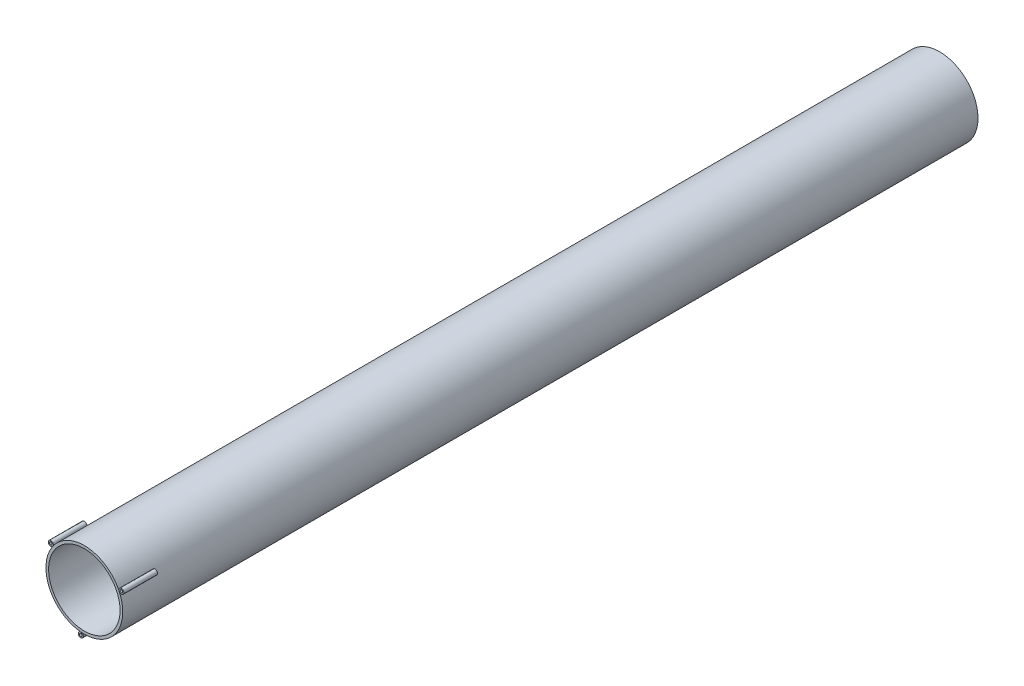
ISO-10303-21;
HEADER;
FILE_DESCRIPTION(('STEP AP214'),'2;1');
FILE_NAME('part.step','',(''),(''),'','','');
FILE_SCHEMA(('AUTOMOTIVE_DESIGN { 1 0 10303 214 1 1 1 1 }'));
ENDSEC;
DATA;
#1=APPLICATION_CONTEXT('core data for automotive mechanical design processes');
#2=APPLICATION_PROTOCOL_DEFINITION('international standard','automotive_design',2000,#1);
#3=PRODUCT_CONTEXT('',#1,'mechanical');
#4=PRODUCT('Part','Part','',(#3));
#5=PRODUCT_RELATED_PRODUCT_CATEGORY('part','',(#4));
#6=PRODUCT_DEFINITION_FORMATION('','',#4);
#7=PRODUCT_DEFINITION_CONTEXT('part definition',#1,'design');
#8=PRODUCT_DEFINITION('design','',#6,#7);
#9=PRODUCT_DEFINITION_SHAPE('','',#8);
#10=(LENGTH_UNIT() NAMED_UNIT(*) SI_UNIT(.MILLI.,.METRE.));
#11=(NAMED_UNIT(*) PLANE_ANGLE_UNIT() SI_UNIT($,.RADIAN.));
#12=(NAMED_UNIT(*) SI_UNIT($,.STERADIAN.) SOLID_ANGLE_UNIT());
#13=UNCERTAINTY_MEASURE_WITH_UNIT(LENGTH_MEASURE(1.E-05),#10,'distance_accuracy_value','');
#14=(GEOMETRIC_REPRESENTATION_CONTEXT(3) GLOBAL_UNCERTAINTY_ASSIGNED_CONTEXT((#13)) GLOBAL_UNIT_ASSIGNED_CONTEXT((#10,
#11,#12)) REPRESENTATION_CONTEXT('',''));
#15=CARTESIAN_POINT('',(0.,0.,0.));
#16=DIRECTION('',(0.,0.,1.));
#17=DIRECTION('',(1.,0.,0.));
#18=AXIS2_PLACEMENT_3D('',#15,#16,#17);
#19=CARTESIAN_POINT('',(-25.3931746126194,17.7607102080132,622.3));
#20=DIRECTION('',(0.,0.,1.));
#21=DIRECTION('',(1.,0.,0.));
#22=AXIS2_PLACEMENT_3D('',#19,#20,#21);
#23=CYLINDRICAL_SURFACE('',#22,1.905);
#24=CARTESIAN_POINT('',(-25.3931746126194,17.7607102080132,622.3));
#25=DIRECTION('',(0.,0.,1.));
#26=DIRECTION('',(1.,0.,0.));
#27=AXIS2_PLACEMENT_3D('',#24,#25,#26);
#28=CIRCLE('',#27,1.905);
#29=CARTESIAN_POINT('',(-23.4881746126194,17.7607102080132,622.3));
#30=VERTEX_POINT('',#29);
#31=EDGE_CURVE('E11',#30,#30,#28,.T.);
#32=ORIENTED_EDGE('',*,*,#31,.T.);
#33=EDGE_LOOP('',(#32));
#34=FACE_BOUND('',#33,.T.);
#35=CARTESIAN_POINT('',(-25.3931746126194,17.7607102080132,647.7));
#36=DIRECTION('',(0.,0.,1.));
#37=DIRECTION('',(1.,0.,0.));
#38=AXIS2_PLACEMENT_3D('',#35,#36,#37);
#39=CIRCLE('',#38,1.905);
#40=CARTESIAN_POINT('',(-23.4881746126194,17.7607102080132,647.7));
#41=VERTEX_POINT('',#40);
#42=EDGE_CURVE('E44',#41,#41,#39,.T.);
#43=ORIENTED_EDGE('',*,*,#42,.F.);
#44=EDGE_LOOP('',(#43));
#45=FACE_BOUND('',#44,.T.);
#46=ADVANCED_FACE('F38',(#34,#45),#23,.T.);
#47=CARTESIAN_POINT('',(-25.3931746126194,17.7607102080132,622.3));
#48=DIRECTION('',(0.,0.,1.));
#49=DIRECTION('',(1.,0.,0.));
#50=AXIS2_PLACEMENT_3D('',#47,#48,#49);
#51=PLANE('',#50);
#52=CARTESIAN_POINT('',(-25.3931746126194,17.7607102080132,622.3));
#53=DIRECTION('',(0.,0.,1.));
#54=DIRECTION('',(1.,0.,0.));
#55=AXIS2_PLACEMENT_3D('',#52,#53,#54);
#56=CIRCLE('',#55,1.016);
#57=CARTESIAN_POINT('',(-24.3771746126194,17.7607102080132,622.3));
#58=VERTEX_POINT('',#57);
#59=EDGE_CURVE('E48',#58,#58,#56,.T.);
#60=ORIENTED_EDGE('',*,*,#59,.T.);
#61=EDGE_LOOP('',(#60));
#62=FACE_BOUND('',#61,.T.);
#63=ORIENTED_EDGE('',*,*,#31,.F.);
#64=EDGE_LOOP('',(#63));
#65=FACE_BOUND('',#64,.T.);
#66=ADVANCED_FACE('F62',(#62,#65),#51,.F.);
#67=CARTESIAN_POINT('',(-25.3931746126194,17.7607102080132,647.7));
#68=DIRECTION('',(0.,0.,1.));
#69=DIRECTION('',(1.,0.,0.));
#70=AXIS2_PLACEMENT_3D('',#67,#68,#69);
#71=PLANE('',#70);
#72=CARTESIAN_POINT('',(-25.3931746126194,17.7607102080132,647.7));
#73=DIRECTION('',(0.,0.,1.));
#74=DIRECTION('',(1.,0.,0.));
#75=AXIS2_PLACEMENT_3D('',#72,#73,#74);
#76=CIRCLE('',#75,1.016);
#77=CARTESIAN_POINT('',(-24.3771746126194,17.7607102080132,647.7));
#78=VERTEX_POINT('',#77);
#79=EDGE_CURVE('E52',#78,#78,#76,.T.);
#80=ORIENTED_EDGE('',*,*,#79,.F.);
#81=EDGE_LOOP('',(#80));
#82=FACE_BOUND('',#81,.T.);
#83=ORIENTED_EDGE('',*,*,#42,.T.);
#84=EDGE_LOOP('',(#83));
#85=FACE_BOUND('',#84,.T.);
#86=ADVANCED_FACE('F60',(#82,#85),#71,.T.);
#87=CARTESIAN_POINT('',(-25.3931746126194,17.7607102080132,622.3));
#88=DIRECTION('',(0.,0.,1.));
#89=DIRECTION('',(1.,0.,0.));
#90=AXIS2_PLACEMENT_3D('',#87,#88,#89);
#91=CYLINDRICAL_SURFACE('',#90,1.016);
#92=ORIENTED_EDGE('',*,*,#59,.F.);
#93=EDGE_LOOP('',(#92));
#94=FACE_BOUND('',#93,.T.);
#95=ORIENTED_EDGE('',*,*,#79,.T.);
#96=EDGE_LOOP('',(#95));
#97=FACE_BOUND('',#96,.T.);
#98=ADVANCED_FACE('F58',(#94,#97),#91,.F.);
#99=CLOSED_SHELL('',(#46,#66,#86,#98));
#100=MANIFOLD_SOLID_BREP('B2',#99);
#101=CARTESIAN_POINT('',(28.0778135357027,13.1107791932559,622.3));
#102=DIRECTION('',(0.,0.,1.));
#103=DIRECTION('',(1.,0.,0.));
#104=AXIS2_PLACEMENT_3D('',#101,#102,#103);
#105=CYLINDRICAL_SURFACE('',#104,1.905);
#106=CARTESIAN_POINT('',(28.0778135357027,13.1107791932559,622.3));
#107=DIRECTION('',(0.,0.,1.));
#108=DIRECTION('',(1.,0.,0.));
#109=AXIS2_PLACEMENT_3D('',#106,#107,#108);
#110=CIRCLE('',#109,1.905);
#111=CARTESIAN_POINT('',(29.9828135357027,13.1107791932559,622.3));
#112=VERTEX_POINT('',#111);
#113=EDGE_CURVE('E37',#112,#112,#110,.T.);
#114=ORIENTED_EDGE('',*,*,#113,.T.);
#115=EDGE_LOOP('',(#114));
#116=FACE_BOUND('',#115,.T.);
#117=CARTESIAN_POINT('',(28.0778135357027,13.1107791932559,647.7));
#118=DIRECTION('',(0.,0.,1.));
#119=DIRECTION('',(1.,0.,0.));
#120=AXIS2_PLACEMENT_3D('',#117,#118,#119);
#121=CIRCLE('',#120,1.905);
#122=CARTESIAN_POINT('',(29.9828135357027,13.1107791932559,647.7));
#123=VERTEX_POINT('',#122);
#124=EDGE_CURVE('E114',#123,#123,#121,.T.);
#125=ORIENTED_EDGE('',*,*,#124,.F.);
#126=EDGE_LOOP('',(#125));
#127=FACE_BOUND('',#126,.T.);
#128=ADVANCED_FACE('F108',(#116,#127),#105,.T.);
#129=CARTESIAN_POINT('',(28.0778135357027,13.1107791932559,622.3));
#130=DIRECTION('',(0.,0.,1.));
#131=DIRECTION('',(1.,0.,0.));
#132=AXIS2_PLACEMENT_3D('',#129,#130,#131);
#133=PLANE('',#132);
#134=CARTESIAN_POINT('',(28.0778135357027,13.1107791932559,622.3));
#135=DIRECTION('',(0.,0.,1.));
#136=DIRECTION('',(1.,0.,0.));
#137=AXIS2_PLACEMENT_3D('',#134,#135,#136);
#138=CIRCLE('',#137,1.016);
#139=CARTESIAN_POINT('',(29.0938135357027,13.1107791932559,622.3));
#140=VERTEX_POINT('',#139);
#141=EDGE_CURVE('E118',#140,#140,#138,.T.);
#142=ORIENTED_EDGE('',*,*,#141,.T.);
#143=EDGE_LOOP('',(#142));
#144=FACE_BOUND('',#143,.T.);
#145=ORIENTED_EDGE('',*,*,#113,.F.);
#146=EDGE_LOOP('',(#145));
#147=FACE_BOUND('',#146,.T.);
#148=ADVANCED_FACE('F132',(#144,#147),#133,.F.);
#149=CARTESIAN_POINT('',(28.0778135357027,13.1107791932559,647.7));
#150=DIRECTION('',(0.,0.,1.));
#151=DIRECTION('',(1.,0.,0.));
#152=AXIS2_PLACEMENT_3D('',#149,#150,#151);
#153=PLANE('',#152);
#154=CARTESIAN_POINT('',(28.0778135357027,13.1107791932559,647.7));
#155=DIRECTION('',(0.,0.,1.));
#156=DIRECTION('',(1.,0.,0.));
#157=AXIS2_PLACEMENT_3D('',#154,#155,#156);
#158=CIRCLE('',#157,1.016);
#159=CARTESIAN_POINT('',(29.0938135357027,13.1107791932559,647.7));
#160=VERTEX_POINT('',#159);
#161=EDGE_CURVE('E122',#160,#160,#158,.T.);
#162=ORIENTED_EDGE('',*,*,#161,.F.);
#163=EDGE_LOOP('',(#162));
#164=FACE_BOUND('',#163,.T.);
#165=ORIENTED_EDGE('',*,*,#124,.T.);
#166=EDGE_LOOP('',(#165));
#167=FACE_BOUND('',#166,.T.);
#168=ADVANCED_FACE('F130',(#164,#167),#153,.T.);
#169=CARTESIAN_POINT('',(28.0778135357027,13.1107791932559,622.3));
#170=DIRECTION('',(0.,0.,1.));
#171=DIRECTION('',(1.,0.,0.));
#172=AXIS2_PLACEMENT_3D('',#169,#170,#171);
#173=CYLINDRICAL_SURFACE('',#172,1.016);
#174=ORIENTED_EDGE('',*,*,#141,.F.);
#175=EDGE_LOOP('',(#174));
#176=FACE_BOUND('',#175,.T.);
#177=ORIENTED_EDGE('',*,*,#161,.T.);
#178=EDGE_LOOP('',(#177));
#179=FACE_BOUND('',#178,.T.);
#180=ADVANCED_FACE('F128',(#176,#179),#173,.F.);
#181=CLOSED_SHELL('',(#128,#148,#168,#180));
#182=MANIFOLD_SOLID_BREP('B6',#181);
#183=CARTESIAN_POINT('',(-2.68463892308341,-30.871489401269,622.3));
#184=DIRECTION('',(0.,0.,1.));
#185=DIRECTION('',(1.,0.,0.));
#186=AXIS2_PLACEMENT_3D('',#183,#184,#185);
#187=CYLINDRICAL_SURFACE('',#186,1.905);
#188=CARTESIAN_POINT('',(-2.68463892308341,-30.871489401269,622.3));
#189=DIRECTION('',(0.,0.,1.));
#190=DIRECTION('',(1.,0.,0.));
#191=AXIS2_PLACEMENT_3D('',#188,#189,#190);
#192=CIRCLE('',#191,1.905);
#193=CARTESIAN_POINT('',(-0.779638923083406,-30.871489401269,622.3));
#194=VERTEX_POINT('',#193);
#195=EDGE_CURVE('E107',#194,#194,#192,.T.);
#196=ORIENTED_EDGE('',*,*,#195,.T.);
#197=EDGE_LOOP('',(#196));
#198=FACE_BOUND('',#197,.T.);
#199=CARTESIAN_POINT('',(-2.68463892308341,-30.871489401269,647.7));
#200=DIRECTION('',(0.,0.,1.));
#201=DIRECTION('',(1.,0.,0.));
#202=AXIS2_PLACEMENT_3D('',#199,#200,#201);
#203=CIRCLE('',#202,1.905);
#204=CARTESIAN_POINT('',(-0.779638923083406,-30.871489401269,647.7));
#205=VERTEX_POINT('',#204);
#206=EDGE_CURVE('E183',#205,#205,#203,.T.);
#207=ORIENTED_EDGE('',*,*,#206,.F.);
#208=EDGE_LOOP('',(#207));
#209=FACE_BOUND('',#208,.T.);
#210=ADVANCED_FACE('F177',(#198,#209),#187,.T.);
#211=CARTESIAN_POINT('',(-2.68463892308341,-30.871489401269,622.3));
#212=DIRECTION('',(0.,0.,1.));
#213=DIRECTION('',(1.,0.,0.));
#214=AXIS2_PLACEMENT_3D('',#211,#212,#213);
#215=PLANE('',#214);
#216=CARTESIAN_POINT('',(-2.68463892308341,-30.871489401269,622.3));
#217=DIRECTION('',(0.,0.,1.));
#218=DIRECTION('',(1.,0.,0.));
#219=AXIS2_PLACEMENT_3D('',#216,#217,#218);
#220=CIRCLE('',#219,1.016);
#221=CARTESIAN_POINT('',(-1.66863892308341,-30.871489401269,622.3));
#222=VERTEX_POINT('',#221);
#223=EDGE_CURVE('E187',#222,#222,#220,.T.);
#224=ORIENTED_EDGE('',*,*,#223,.T.);
#225=EDGE_LOOP('',(#224));
#226=FACE_BOUND('',#225,.T.);
#227=ORIENTED_EDGE('',*,*,#195,.F.);
#228=EDGE_LOOP('',(#227));
#229=FACE_BOUND('',#228,.T.);
#230=ADVANCED_FACE('F201',(#226,#229),#215,.F.);
#231=CARTESIAN_POINT('',(-2.68463892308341,-30.871489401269,647.7));
#232=DIRECTION('',(0.,0.,1.));
#233=DIRECTION('',(1.,0.,0.));
#234=AXIS2_PLACEMENT_3D('',#231,#232,#233);
#235=PLANE('',#234);
#236=CARTESIAN_POINT('',(-2.68463892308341,-30.871489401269,647.7));
#237=DIRECTION('',(0.,0.,1.));
#238=DIRECTION('',(1.,0.,0.));
#239=AXIS2_PLACEMENT_3D('',#236,#237,#238);
#240=CIRCLE('',#239,1.016);
#241=CARTESIAN_POINT('',(-1.66863892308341,-30.871489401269,647.7));
#242=VERTEX_POINT('',#241);
#243=EDGE_CURVE('E191',#242,#242,#240,.T.);
#244=ORIENTED_EDGE('',*,*,#243,.F.);
#245=EDGE_LOOP('',(#244));
#246=FACE_BOUND('',#245,.T.);
#247=ORIENTED_EDGE('',*,*,#206,.T.);
#248=EDGE_LOOP('',(#247));
#249=FACE_BOUND('',#248,.T.);
#250=ADVANCED_FACE('F199',(#246,#249),#235,.T.);
#251=CARTESIAN_POINT('',(-2.68463892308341,-30.871489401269,622.3));
#252=DIRECTION('',(0.,0.,1.));
#253=DIRECTION('',(1.,0.,0.));
#254=AXIS2_PLACEMENT_3D('',#251,#252,#253);
#255=CYLINDRICAL_SURFACE('',#254,1.016);
#256=ORIENTED_EDGE('',*,*,#223,.F.);
#257=EDGE_LOOP('',(#256));
#258=FACE_BOUND('',#257,.T.);
#259=ORIENTED_EDGE('',*,*,#243,.T.);
#260=EDGE_LOOP('',(#259));
#261=FACE_BOUND('',#260,.T.);
#262=ADVANCED_FACE('F197',(#258,#261),#255,.F.);
#263=CLOSED_SHELL('',(#210,#230,#250,#262));
#264=MANIFOLD_SOLID_BREP('B32',#263);
#265=CARTESIAN_POINT('',(0.,0.,647.7));
#266=DIRECTION('',(0.,0.,1.));
#267=DIRECTION('',(1.,0.,0.));
#268=AXIS2_PLACEMENT_3D('',#265,#266,#267);
#269=PLANE('',#268);
#270=CARTESIAN_POINT('',(0.,0.,647.7));
#271=DIRECTION('',(0.,0.,1.));
#272=DIRECTION('',(1.,0.,0.));
#273=AXIS2_PLACEMENT_3D('',#270,#271,#272);
#274=CIRCLE('',#273,29.083);
#275=CARTESIAN_POINT('',(29.083,0.,647.7));
#276=VERTEX_POINT('',#275);
#277=EDGE_CURVE('E176',#276,#276,#274,.T.);
#278=ORIENTED_EDGE('',*,*,#277,.T.);
#279=EDGE_LOOP('',(#278));
#280=FACE_BOUND('',#279,.T.);
#281=CARTESIAN_POINT('',(0.,0.,647.7));
#282=DIRECTION('',(0.,0.,1.));
#283=DIRECTION('',(1.,0.,0.));
#284=AXIS2_PLACEMENT_3D('',#281,#282,#283);
#285=CIRCLE('',#284,27.051);
#286=CARTESIAN_POINT('',(27.051,0.,647.7));
#287=VERTEX_POINT('',#286);
#288=EDGE_CURVE('E250',#287,#287,#285,.T.);
#289=ORIENTED_EDGE('',*,*,#288,.F.);
#290=EDGE_LOOP('',(#289));
#291=FACE_BOUND('',#290,.T.);
#292=ADVANCED_FACE('F239',(#280,#291),#269,.T.);
#293=CARTESIAN_POINT('',(0.,0.,0.));
#294=DIRECTION('',(0.,0.,1.));
#295=DIRECTION('',(1.,0.,0.));
#296=AXIS2_PLACEMENT_3D('',#293,#294,#295);
#297=PLANE('',#296);
#298=CARTESIAN_POINT('',(0.,0.,0.));
#299=DIRECTION('',(0.,0.,1.));
#300=DIRECTION('',(1.,0.,0.));
#301=AXIS2_PLACEMENT_3D('',#298,#299,#300);
#302=CIRCLE('',#301,29.083);
#303=CARTESIAN_POINT('',(29.083,0.,0.));
#304=VERTEX_POINT('',#303);
#305=EDGE_CURVE('E246',#304,#304,#302,.T.);
#306=ORIENTED_EDGE('',*,*,#305,.F.);
#307=EDGE_LOOP('',(#306));
#308=FACE_BOUND('',#307,.T.);
#309=CARTESIAN_POINT('',(0.,0.,0.));
#310=DIRECTION('',(0.,0.,1.));
#311=DIRECTION('',(1.,0.,0.));
#312=AXIS2_PLACEMENT_3D('',#309,#310,#311);
#313=CIRCLE('',#312,27.051);
#314=CARTESIAN_POINT('',(27.051,0.,0.));
#315=VERTEX_POINT('',#314);
#316=EDGE_CURVE('E254',#315,#315,#313,.T.);
#317=ORIENTED_EDGE('',*,*,#316,.T.);
#318=EDGE_LOOP('',(#317));
#319=FACE_BOUND('',#318,.T.);
#320=ADVANCED_FACE('F260',(#308,#319),#297,.F.);
#321=CARTESIAN_POINT('',(0.,0.,647.7));
#322=DIRECTION('',(0.,0.,-1.));
#323=DIRECTION('',(-1.,0.,0.));
#324=AXIS2_PLACEMENT_3D('',#321,#322,#323);
#325=CYLINDRICAL_SURFACE('',#324,29.083);
#326=ORIENTED_EDGE('',*,*,#277,.F.);
#327=EDGE_LOOP('',(#326));
#328=FACE_BOUND('',#327,.T.);
#329=ORIENTED_EDGE('',*,*,#305,.T.);
#330=EDGE_LOOP('',(#329));
#331=FACE_BOUND('',#330,.T.);
#332=ADVANCED_FACE('F241',(#328,#331),#325,.T.);
#333=CARTESIAN_POINT('',(0.,0.,647.7));
#334=DIRECTION('',(0.,0.,-1.));
#335=DIRECTION('',(-1.,0.,0.));
#336=AXIS2_PLACEMENT_3D('',#333,#334,#335);
#337=CYLINDRICAL_SURFACE('',#336,27.051);
#338=ORIENTED_EDGE('',*,*,#288,.T.);
#339=EDGE_LOOP('',(#338));
#340=FACE_BOUND('',#339,.T.);
#341=ORIENTED_EDGE('',*,*,#316,.F.);
#342=EDGE_LOOP('',(#341));
#343=FACE_BOUND('',#342,.T.);
#344=ADVANCED_FACE('F262',(#340,#343),#337,.F.);
#345=CLOSED_SHELL('',(#292,#320,#332,#344));
#346=MANIFOLD_SOLID_BREP('B102',#345);
#347=ADVANCED_BREP_SHAPE_REPRESENTATION('',(#18,#100,#182,#264,#346),#14);
#348=SHAPE_DEFINITION_REPRESENTATION(#9,#347);
ENDSEC;
END-ISO-10303-21;
